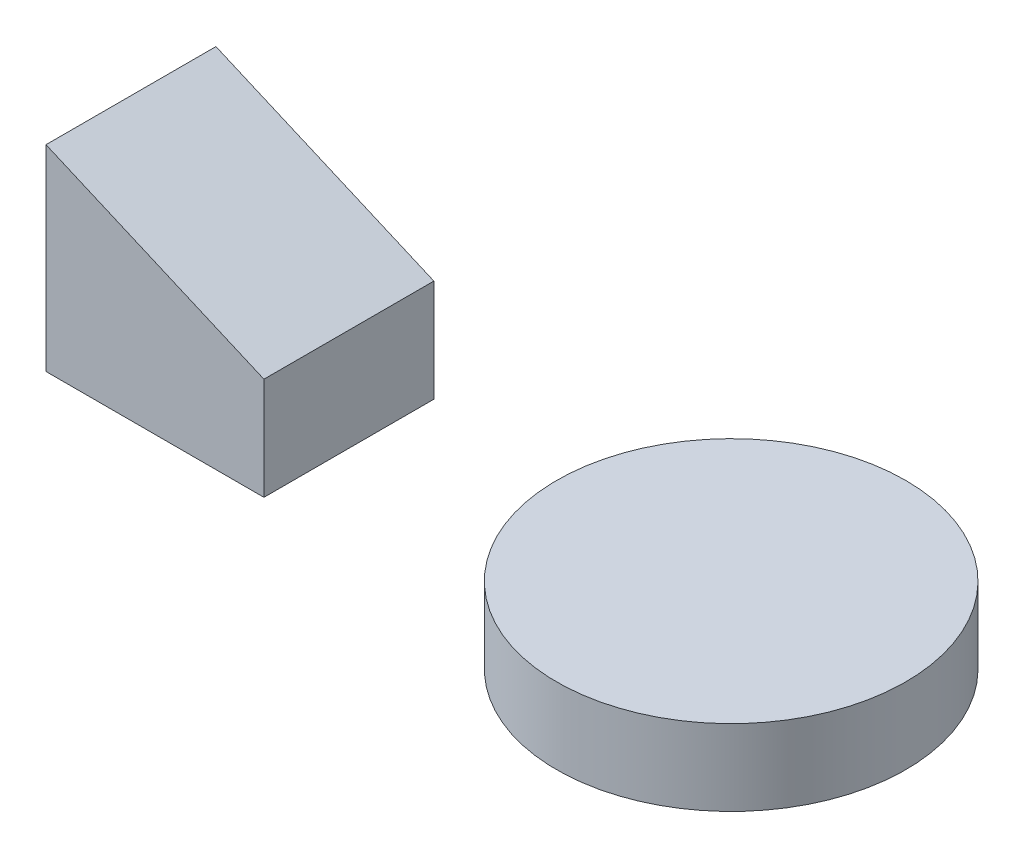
from build123d import *

# Parameters (mm, degrees)
EXTRUDE1_DEPTH = 97.028
SKETCH2_R      = 99.65792716
EXTRUDE2_DEPTH = 43.434


with BuildPart() as part:
    # Sketch1 → Extrude1 (new body)
    with BuildSketch(Plane.XY):
        Polygon((0, 0), (124.432199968, 0), (124.432199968, 58.427972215), (0, 112.167883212), align=None)
    extrude(amount=EXTRUDE1_DEPTH)


with BuildPart() as body_2:
    # Sketch2 → Extrude2 (new body)
    with BuildSketch(Plane(origin=(0, 0, 0), x_dir=(1, 0, 0), z_dir=(0, 1, 0))):
        with Locations(Location((342.699060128, -48.514, 0), (0, 0, 90))):
            Circle(SKETCH2_R)
    extrude(amount=EXTRUDE2_DEPTH)


solid = Compound([part.part, body_2.part])
